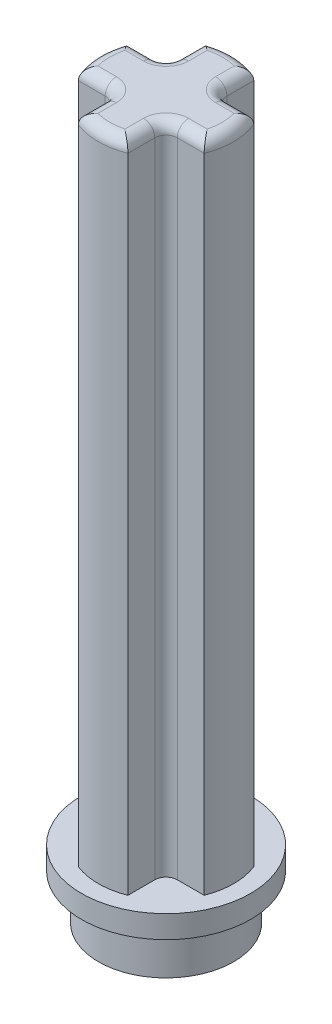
from build123d import *

# Parameters (mm, degrees)
BOSS_EXTRUDE1_DEPTH = 23.2
FILLET7_R           = 0.4
SKETCH2_R           = 3
BOSS_EXTRUDE2_DEPTH = 0.8
BOSS_EXTRUDE3_START = 1.6
SKETCH3_R           = 2.4
SKETCH3_R_2         = 1.6
BOSS_EXTRUDE3_DEPTH = 1.6


with BuildPart() as part:
    # Sketch1 → Boss-Extrude1 (new body)
    with BuildSketch(Plane(origin=(0, 0, 0), x_dir=(1, 0, 0), z_dir=(0, 1, 0))):
        with BuildLine():
            Line((-2.232845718, 0.88), (-0.88, 0.88))
            Line((-0.88, 0.88), (-0.88, 2.232845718))
            ThreePointArc((-0.88, 2.232845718), (0, 2.4), (0.88, 2.232845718))
            Line((0.88, 2.232845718), (0.88, 0.88))
            Line((0.88, 0.88), (2.232845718, 0.88))
            ThreePointArc((2.232845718, 0.88), (2.4, 0), (2.232845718, -0.88))
            Line((2.232845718, -0.88), (0.88, -0.88))
            Line((0.88, -0.88), (0.88, -2.232845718))
            ThreePointArc((0.88, -2.232845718), (0, -2.4), (-0.88, -2.232845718))
            Line((-0.88, -2.232845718), (-0.88, -0.88))
            Line((-0.88, -0.88), (-2.232845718, -0.88))
            ThreePointArc((-2.232845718, -0.88), (-2.4, 0), (-2.232845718, 0.88))
        make_face()
    extrude(amount=BOSS_EXTRUDE1_DEPTH)

    # Fillet7
    fillet7_edges = [part.edges().sort_by_distance(p)[0] for p in [
        (-2.4, 23.2, 0),
        (-1.556422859, 23.2, 0.88),
        (-0.88, 23.2, 1.556422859),
        (0, 23.2, 2.4),
        (0.88, 11.6, -0.88),
        (0.88, 11.6, 0.88),
        (-0.88, 11.6, 0.88),
        (-0.88, 11.6, -0.88),
        (0.88, 23.2, 1.556422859),
        (1.556422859, 23.2, 0.88),
        (2.4, 23.2, 0),
        (1.556422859, 23.2, -0.88),
        (0.88, 23.2, -1.556422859),
        (0, 23.2, -2.4),
        (-0.88, 23.2, -1.556422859),
        (-1.556422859, 23.2, -0.88),
    ]]
    fillet(fillet7_edges, radius=FILLET7_R)

    # Sketch2 → Boss-Extrude2 (add)
    with BuildSketch(Plane.XZ):
        with Locations(Location((0, 0, 0), (0, 0, 270))):
            Circle(SKETCH2_R)
    extrude(amount=BOSS_EXTRUDE2_DEPTH)

    # Sketch3 → Boss-Extrude3 (add)
    with BuildSketch(Plane.XZ.offset(0.8).offset(BOSS_EXTRUDE3_START)):
        with Locations(Location((0, 0, 0), (0, 0, 270))):
            Circle(SKETCH3_R)
        with Locations(Location((0, 0, 0), (0, 0, 270))):
            Circle(SKETCH3_R_2, mode=Mode.SUBTRACT)
    extrude(amount=-BOSS_EXTRUDE3_DEPTH)


solid = part.part
